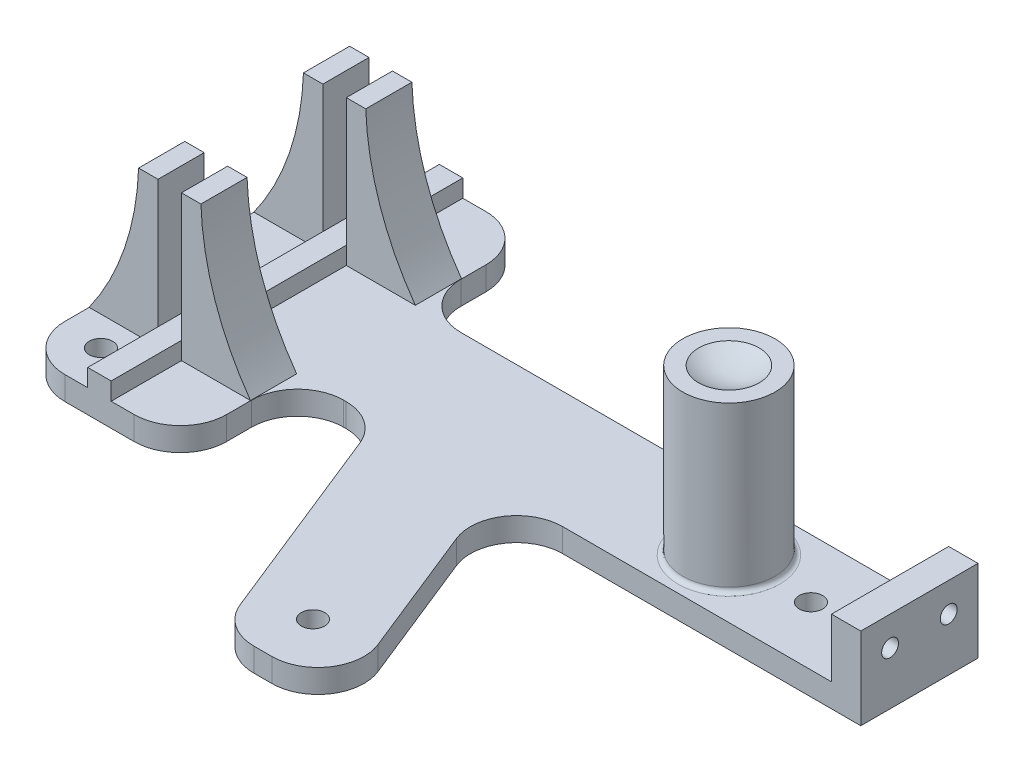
from build123d import *

# Parameters (mm, degrees)
BOSS_EXTRUDE1_DEPTH       = 5.08
BOSS_EXTRUDE2_DEPTH       = 10
SKETCH3_R                 = 10
BOSS_EXTRUDE3_DEPTH       = 35.56
FILLET1_R                 = 1
SKETCH9_W                 = 6.35
SKETCH9_H                 = 25.4
BOSS_EXTRUDE6_DEPTH       = 12.7
F_6_CLEARANCE_HOLE1_D     = 3.6576
F_6_CLEARANCE_HOLE1_DEPTH = 6.35
BOSS_EXTRUDE7_DEPTH       = 5.08
FILLET4_R                 = 10
FILLET5_R                 = 10
CUT_EXTRUDE1_REACH        = 156.709
SKETCH18_R                = 2.54
SKETCH21_W                = 5.08
SKETCH21_H                = 76.2
BOSS_EXTRUDE8_DEPTH       = 3.81
SKETCH22_W                = 9.525
SKETCH22_H                = 25.4
BOSS_EXTRUDE9_DEPTH       = 17.78
F_6_CLEARANCE_HOLE2_D     = 3.6576
F_6_CLEARANCE_HOLE2_DEPTH = 9.525
SKETCH25_W                = 9.525
SKETCH25_H                = 25.4
CUT_EXTRUDE2_DEPTH        = 12.7


with BuildPart() as part:
    # Sketch1 → Boss-Extrude1 (new body)
    with BuildSketch(Plane(origin=(0, 0, 0), x_dir=(1, 0, 0), z_dir=(0, 1, 0))):
        with BuildLine():
            Line((20.08, 28.1), (20.08, 22.7))
            ThreePointArc((20.08, 22.7), (23.008932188, 15.628932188), (30.08, 12.7))
            Line((30.08, 12.7), (126.24, 12.7))
            Line((126.24, 12.7), (132.59, 12.7))
            Line((132.59, 12.7), (132.59, 0))
            Line((132.59, 0), (132.59, -12.7))
            Line((132.59, -12.7), (126.24, -12.7))
            Line((126.24, -12.7), (30.08, -12.7))
            ThreePointArc((30.08, -12.7), (23.008932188, -15.628932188), (20.08, -22.7))
            Line((20.08, -22.7), (20.08, -28.1))
            ThreePointArc((20.08, -28.1), (17.151067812, -35.171067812), (10.08, -38.1))
            Line((10.08, -38.1), (-4.92, -38.1))
            ThreePointArc((-4.92, -38.1), (-11.991067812, -35.171067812), (-14.92, -28.1))
            Line((-14.92, -28.1), (-14.92, 28.1))
            ThreePointArc((-14.92, 28.1), (-11.991067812, 35.171067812), (-4.92, 38.1))
            Line((-4.92, 38.1), (10.08, 38.1))
            ThreePointArc((10.08, 38.1), (17.151067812, 35.171067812), (20.08, 28.1))
        make_face()
    extrude(amount=-BOSS_EXTRUDE1_DEPTH)

    # Sketch2 → Boss-Extrude2 (add)
    with BuildSketch(Plane.XY.offset(22.86)):
        with BuildLine():
            Line((0, 0), (-14.953299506, 0))
            ThreePointArc((-14.953299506, 0), (-7.255141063, 14.95657571), (-4.209502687, 31.5))
            Line((-4.209502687, 31.5), (0, 31.5))
            Line((0, 31.5), (0, 0))
        make_face()
        with BuildLine():
            Line((5.08, 0), (20.033299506, 0))
            ThreePointArc((20.033299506, 0), (12.335141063, 14.95657571), (9.289502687, 31.5))
            Line((9.289502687, 31.5), (5.08, 31.5))
            Line((5.08, 31.5), (5.08, 0))
        make_face()
    boss_extrude2 = extrude(amount=-BOSS_EXTRUDE2_DEPTH)

    # Mirror1: Boss-Extrude2 across plane
    add(boss_extrude2.mirror(Plane.XY))

    # Sketch3 → Boss-Extrude3 (add)
    with BuildSketch(Plane(origin=(0, 0, 0), x_dir=(1, 0, 0), z_dir=(0, 1, 0))):
        with Locations(Location((100.84, 0, 0), (0, 0, 90))):
            Circle(SKETCH3_R)
    extrude(amount=BOSS_EXTRUDE3_DEPTH)

    # Fillet1
    fillet1_edges = [part.edges().sort_by_distance(p)[0] for p in [
        (100.84, 0, 10),
    ]]
    fillet(fillet1_edges, radius=FILLET1_R)

    # Sketch4 → Cut-Revolve1 (revolve, cut)
    with BuildSketch(Plane.XY, mode=Mode.PRIVATE) as cut_revolve1_sk:
        with BuildLine():
            Line((100.84, 35.56), (107.399510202, 35.56))
            ThreePointArc((107.399510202, 35.56), (104.235709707, 34.2471456), (100.84, 33.797283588))
            Line((100.84, 33.797283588), (100.84, 35.56))
        make_face()
    revolve(cut_revolve1_sk.sketch.rotate(Axis((100.84, 35.56, 0), (0, -1, 0)), 90), axis=Axis((100.84, 35.56, 0), (0, -1, 0)), mode=Mode.SUBTRACT)

    # Sketch9 → Boss-Extrude6 (add)
    with BuildSketch(Plane(origin=(0, 0, 0), x_dir=(1, 0, 0), z_dir=(0, 1, 0))):
        with Locations((129.415, 0)):
            Rectangle(SKETCH9_W, SKETCH9_H)
    extrude(amount=BOSS_EXTRUDE6_DEPTH)

    # 6 Clearance Hole1
    with Locations(Plane(origin=(132.59, 0, 0), x_dir=(0, 0, -1), z_dir=(1, 0, 0))):
        with Locations((6.35, 6.35), (-6.35, 6.35)):
            Hole(F_6_CLEARANCE_HOLE1_D / 2, depth=F_6_CLEARANCE_HOLE1_DEPTH)

    # Sketch17 → Boss-Extrude7 (add)
    with BuildSketch(Plane(origin=(0, 0, 0), x_dir=(1, 0, 0), z_dir=(0, 1, 0))):
        with BuildLine():
            Line((37.34, -12.7), (57.230452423, -62.301920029))
            ThreePointArc((57.230452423, -62.301920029), (60.909296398, -66.863091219), (66.512010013, -68.58))
            Line((66.512010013, -68.58), (70.36390259, -68.58))
            ThreePointArc((70.36390259, -68.58), (78.646993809, -64.182713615), (79.64546018, -54.858079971))
            Line((79.64546018, -54.858079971), (62.74, -12.7))
            Line((62.74, -12.7), (37.34, -12.7))
        make_face()
    extrude(amount=-BOSS_EXTRUDE7_DEPTH)

    # Fillet4
    fillet4_edges = [part.edges().sort_by_distance(p)[0] for p in [
        (62.74, -2.54, 12.7),
    ]]
    fillet(fillet4_edges, radius=FILLET4_R)

    # Fillet5
    fillet5_edges = [part.edges().sort_by_distance(p)[0] for p in [
        (37.34, -2.54, 12.7),
    ]]
    fillet(fillet5_edges, radius=FILLET5_R)

    # Sketch18 → Cut-Extrude1 (cut, up to next)
    with BuildSketch(Plane.XZ.offset(5.08), mode=Mode.PRIVATE) as cut_extrude1_sk1:
        with Locations(Location((-6.03, 29.21, 0), (0, 0, 270))):
            Circle(SKETCH18_R)
    cut_extrude1_tool1 = extrude(cut_extrude1_sk1.sketch, amount=-CUT_EXTRUDE1_REACH, mode=Mode.PRIVATE) & part.part
    # Sketch18 → Cut-Extrude1 (cut, up to next)
    with BuildSketch(Plane.XZ.offset(5.08), mode=Mode.PRIVATE) as cut_extrude1_sk2:
        with Locations(Location((-6.03, -29.21, 0), (0, 0, 90))):
            Circle(SKETCH18_R)
    cut_extrude1_tool2 = extrude(cut_extrude1_sk2.sketch, amount=-CUT_EXTRUDE1_REACH, mode=Mode.PRIVATE) & part.part
    # Sketch18 → Cut-Extrude1 (cut, up to next)
    with BuildSketch(Plane.XZ.offset(5.08), mode=Mode.PRIVATE) as cut_extrude1_sk3:
        with Locations(Location((67.864523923, 57.15, 0), (0, 0, 270))):
            Circle(SKETCH18_R)
    cut_extrude1_tool3 = extrude(cut_extrude1_sk3.sketch, amount=-CUT_EXTRUDE1_REACH, mode=Mode.PRIVATE) & part.part
    # Sketch18 → Cut-Extrude1 (cut, up to next)
    with BuildSketch(Plane.XZ.offset(5.08), mode=Mode.PRIVATE) as cut_extrude1_sk4:
        with Locations(Location((118.62, 0, 0), (0, 0, 270))):
            Circle(SKETCH18_R)
    cut_extrude1_tool4 = extrude(cut_extrude1_sk4.sketch, amount=-CUT_EXTRUDE1_REACH, mode=Mode.PRIVATE) & part.part
    add(cut_extrude1_tool1.solids().sort_by_distance((-6.03, -5.08, 29.21))[0], mode=Mode.SUBTRACT)
    add(cut_extrude1_tool2.solids().sort_by_distance((-6.03, -5.08, -29.21))[0], mode=Mode.SUBTRACT)
    add(cut_extrude1_tool3.solids().sort_by_distance((67.864524, -5.08, 57.15))[0], mode=Mode.SUBTRACT)
    add(cut_extrude1_tool4.solids().sort_by_distance((118.62, -5.08, 0))[0], mode=Mode.SUBTRACT)

    # Sketch21 → Boss-Extrude8 (add)
    with BuildSketch(Plane(origin=(0, 0, 0), x_dir=(1, 0, 0), z_dir=(0, 1, 0))):
        with Locations((2.54, 0)):
            Rectangle(SKETCH21_W, SKETCH21_H)
    extrude(amount=BOSS_EXTRUDE8_DEPTH)

    # Sketch22 → Boss-Extrude9 (add, through all)
    with BuildSketch(Plane(origin=(0, 12.7, 0), x_dir=(1, 0, 0), z_dir=(0, 1, 0))):
        with Locations((137.3525, 0)):
            Rectangle(SKETCH22_W, SKETCH22_H)
    extrude(amount=-BOSS_EXTRUDE9_DEPTH)

    # 6 Clearance Hole2
    with Locations(Plane.ZY.offset(-132.59)):
        with Locations((6.35, 6.35), (-6.35, 6.35)):
            Hole(F_6_CLEARANCE_HOLE2_D / 2, depth=F_6_CLEARANCE_HOLE2_DEPTH)

    # Sketch25 → Cut-Extrude2 (cut)
    with BuildSketch(Plane(origin=(0, 12.7, 0), x_dir=(1, 0, 0), z_dir=(0, 1, 0))):
        with Locations((131.0025, 0)):
            Rectangle(SKETCH25_W, SKETCH25_H)
    extrude(amount=-CUT_EXTRUDE2_DEPTH, mode=Mode.SUBTRACT)


solid = part.part
